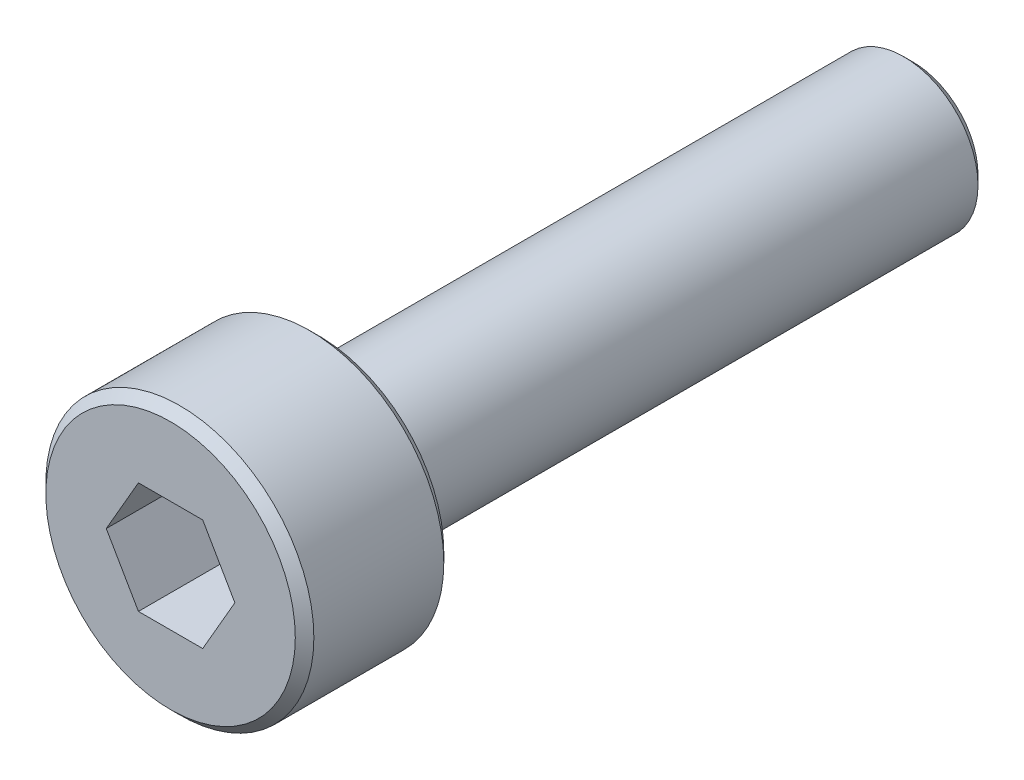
from build123d import *

# Parameters (mm, degrees)
SKETCH1_R           = 2
BOSS_EXTRUDE1_DEPTH = 16
SKETCH2_R           = 3.61
BOSS_EXTRUDE2_DEPTH = 4
CUT_EXTRUDE1_DEPTH  = 2.5
CHAMFER1_SIZE       = 0.25


with BuildPart() as part:
    # Sketch1 → Boss-Extrude1 (new body)
    with BuildSketch(Plane(origin=(0, 0, 0), x_dir=(0, 1, 0), z_dir=(0, 0, 1))):
        with Locations(Location((0, 0, 0), (0, 0, 270))):
            Circle(SKETCH1_R)
    extrude(amount=BOSS_EXTRUDE1_DEPTH)

    # Sketch2 → Boss-Extrude2 (add)
    with BuildSketch(Plane.XY.offset(16)):
        Circle(SKETCH2_R)
    extrude(amount=BOSS_EXTRUDE2_DEPTH)

    # Sketch3 → Cut-Extrude1 (cut)
    with BuildSketch(Plane.XY.offset(20)):
        Polygon((1.732050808, 0), (0.866025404, 1.5), (-0.866025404, 1.5), (-1.732050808, 0), (-0.866025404, -1.5), (0.866025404, -1.5), align=None)
    extrude(amount=-CUT_EXTRUDE1_DEPTH, mode=Mode.SUBTRACT)

    # Chamfer1
    chamfer1_edges = [part.edges().sort_by_distance(p)[0] for p in [
        (-2, 0, 0),
        (-3.61, 0, 16),
        (-3.61, 0, 20),
    ]]
    chamfer(chamfer1_edges, length=CHAMFER1_SIZE)


solid = part.part
